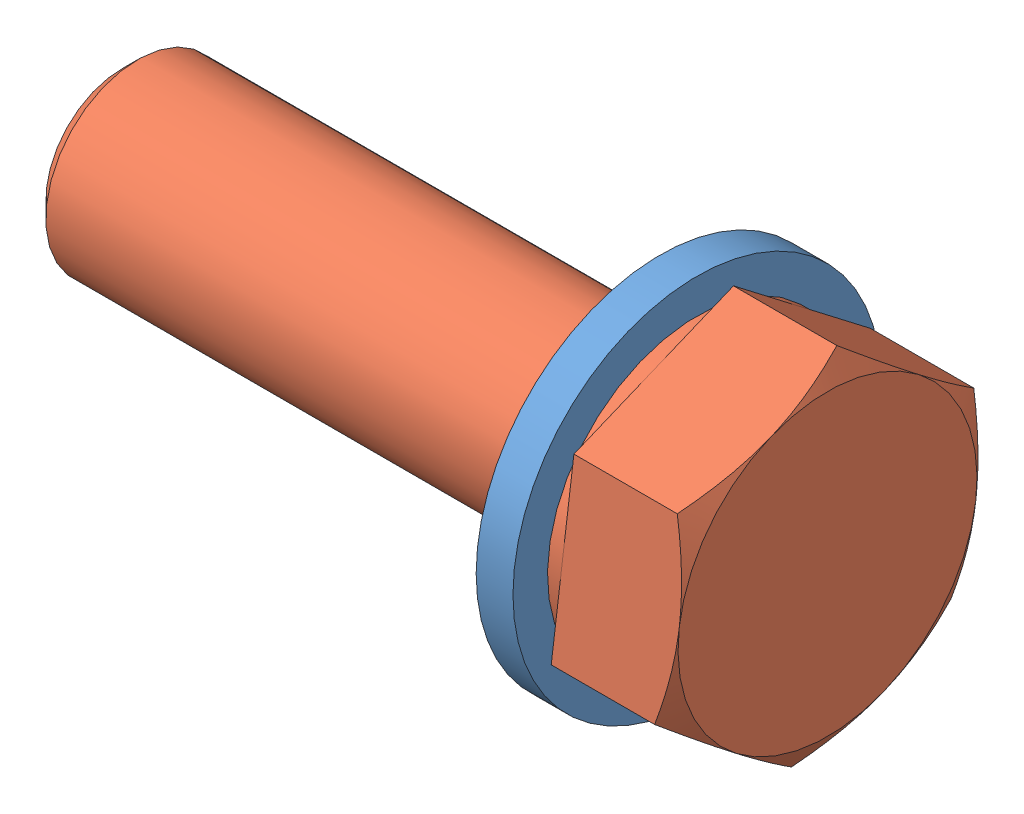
SolidWorks assembly Assemblage1.sldasm, configuration Défaut (file format 3400). Lengths in mm.
Overall size (30.68 17.75 18.84).
2 component instances, 2 part files, 2 mates.
Components (placement in the parent):
- Rondelle M8-1: Rondelle M8.SLDPRT [Washer ISO 7089 - 8] at (-0.6279 0.3811 1.9692) size (1.6 16 16)
- Vis M8 25 mm-1: Vis M8 25 mm.SLDPRT [ISO 4018 - M8 x 25-WC] at (5.0471 0.3811 1.9692) x (-1 0 0) z (0 0.924225 0.381849) size (30.68 15.01 13)
Mates (geometry in assembly coordinates):
- Coaxiale11: concentric: cylinder of ?; cylinder of ?
- Coïncidente11: coincident anti-aligned: plane of ?; plane of ?
